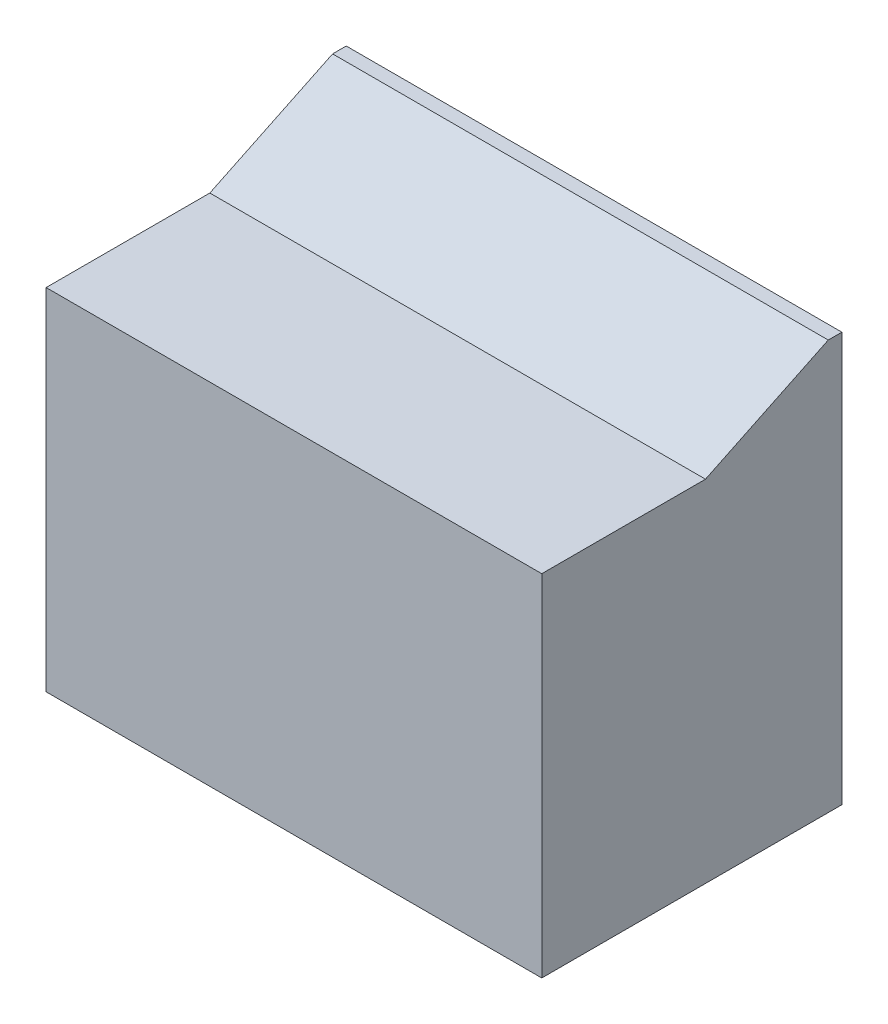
ISO-10303-21;
HEADER;
FILE_DESCRIPTION(('STEP AP214'),'2;1');
FILE_NAME('part.step','',(''),(''),'','','');
FILE_SCHEMA(('AUTOMOTIVE_DESIGN { 1 0 10303 214 1 1 1 1 }'));
ENDSEC;
DATA;
#1=APPLICATION_CONTEXT('core data for automotive mechanical design processes');
#2=APPLICATION_PROTOCOL_DEFINITION('international standard','automotive_design',2000,#1);
#3=PRODUCT_CONTEXT('',#1,'mechanical');
#4=PRODUCT('Part','Part','',(#3));
#5=PRODUCT_RELATED_PRODUCT_CATEGORY('part','',(#4));
#6=PRODUCT_DEFINITION_FORMATION('','',#4);
#7=PRODUCT_DEFINITION_CONTEXT('part definition',#1,'design');
#8=PRODUCT_DEFINITION('design','',#6,#7);
#9=PRODUCT_DEFINITION_SHAPE('','',#8);
#10=(LENGTH_UNIT() NAMED_UNIT(*) SI_UNIT(.MILLI.,.METRE.));
#11=(NAMED_UNIT(*) PLANE_ANGLE_UNIT() SI_UNIT($,.RADIAN.));
#12=(NAMED_UNIT(*) SI_UNIT($,.STERADIAN.) SOLID_ANGLE_UNIT());
#13=UNCERTAINTY_MEASURE_WITH_UNIT(LENGTH_MEASURE(1.E-05),#10,'distance_accuracy_value','');
#14=(GEOMETRIC_REPRESENTATION_CONTEXT(3) GLOBAL_UNCERTAINTY_ASSIGNED_CONTEXT((#13)) GLOBAL_UNIT_ASSIGNED_CONTEXT((#10,
#11,#12)) REPRESENTATION_CONTEXT('',''));
#15=CARTESIAN_POINT('',(0.,0.,0.));
#16=DIRECTION('',(0.,0.,1.));
#17=DIRECTION('',(1.,0.,0.));
#18=AXIS2_PLACEMENT_3D('',#15,#16,#17);
#19=CARTESIAN_POINT('',(-1542.5200318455,386.5,150.));
#20=DIRECTION('',(0.,1.,0.));
#21=DIRECTION('',(-1.,0.,0.));
#22=AXIS2_PLACEMENT_3D('',#19,#20,#21);
#23=PLANE('',#22);
#24=DIRECTION('',(0.,0.,1.));
#25=VECTOR('',#24,1.);
#26=CARTESIAN_POINT('',(-23.5,386.5,330.));
#27=LINE('',#26,#25);
#28=CARTESIAN_POINT('',(-23.5,386.5,329.));
#29=VERTEX_POINT('',#28);
#30=CARTESIAN_POINT('',(-23.4999999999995,386.5,149.771796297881));
#31=VERTEX_POINT('',#30);
#32=EDGE_CURVE('E108',#29,#31,#27,.F.);
#33=ORIENTED_EDGE('',*,*,#32,.F.);
#34=DIRECTION('',(1.,0.,0.));
#35=VECTOR('',#34,1.);
#36=CARTESIAN_POINT('',(-567.5,386.5,329.));
#37=LINE('',#36,#35);
#38=CARTESIAN_POINT('',(-566.5,386.5,329.));
#39=VERTEX_POINT('',#38);
#40=EDGE_CURVE('E19',#29,#39,#37,.F.);
#41=ORIENTED_EDGE('',*,*,#40,.T.);
#42=DIRECTION('',(0.,0.,1.));
#43=VECTOR('',#42,1.);
#44=CARTESIAN_POINT('',(-566.5,386.5,330.));
#45=LINE('',#44,#43);
#46=CARTESIAN_POINT('',(-566.5,386.5,149.771796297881));
#47=VERTEX_POINT('',#46);
#48=EDGE_CURVE('E111',#47,#39,#45,.T.);
#49=ORIENTED_EDGE('',*,*,#48,.F.);
#50=DIRECTION('',(1.,0.,0.));
#51=VECTOR('',#50,1.);
#52=CARTESIAN_POINT('',(-1542.5200318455,386.5,149.771796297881));
#53=LINE('',#52,#51);
#54=EDGE_CURVE('E105',#47,#31,#53,.T.);
#55=ORIENTED_EDGE('',*,*,#54,.T.);
#56=EDGE_LOOP('',(#33,#41,#49,#55));
#57=FACE_BOUND('',#56,.T.);
#58=ADVANCED_FACE('F16',(#57),#23,.F.);
#59=CARTESIAN_POINT('',(-567.5,2.5,329.));
#60=DIRECTION('',(0.,0.,1.));
#61=DIRECTION('',(1.,0.,0.));
#62=AXIS2_PLACEMENT_3D('',#59,#60,#61);
#63=PLANE('',#62);
#64=DIRECTION('',(-1.,0.,0.));
#65=VECTOR('',#64,1.);
#66=CARTESIAN_POINT('',(-567.5,3.5,329.));
#67=LINE('',#66,#65);
#68=CARTESIAN_POINT('',(-566.5,3.5,329.));
#69=VERTEX_POINT('',#68);
#70=CARTESIAN_POINT('',(-23.5,3.5,329.));
#71=VERTEX_POINT('',#70);
#72=EDGE_CURVE('E125',#69,#71,#67,.F.);
#73=ORIENTED_EDGE('',*,*,#72,.F.);
#74=DIRECTION('',(0.,1.,0.));
#75=VECTOR('',#74,1.);
#76=CARTESIAN_POINT('',(-566.5,452.5,329.));
#77=LINE('',#76,#75);
#78=EDGE_CURVE('E137',#39,#69,#77,.F.);
#79=ORIENTED_EDGE('',*,*,#78,.F.);
#80=ORIENTED_EDGE('',*,*,#40,.F.);
#81=DIRECTION('',(0.,1.,0.));
#82=VECTOR('',#81,1.);
#83=CARTESIAN_POINT('',(-23.5,452.5,329.));
#84=LINE('',#83,#82);
#85=EDGE_CURVE('E121',#71,#29,#84,.T.);
#86=ORIENTED_EDGE('',*,*,#85,.F.);
#87=EDGE_LOOP('',(#73,#79,#80,#86));
#88=FACE_BOUND('',#87,.T.);
#89=ADVANCED_FACE('F314',(#88),#63,.F.);
#90=CARTESIAN_POINT('',(-1542.5200318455,451.598998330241,14.5661843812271));
#91=DIRECTION('',(0.,0.9010016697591,0.4338156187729));
#92=DIRECTION('',(0.,-0.4338156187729,0.9010016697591));
#93=AXIS2_PLACEMENT_3D('',#90,#91,#92);
#94=PLANE('',#93);
#95=DIRECTION('',(0.,0.4338156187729,-0.9010016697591));
#96=VECTOR('',#95,1.);
#97=CARTESIAN_POINT('',(-23.5,386.5,149.771796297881));
#98=LINE('',#97,#96);
#99=CARTESIAN_POINT('',(-23.4999999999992,451.5,14.7717962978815));
#100=VERTEX_POINT('',#99);
#101=EDGE_CURVE('E114',#31,#100,#98,.T.);
#102=ORIENTED_EDGE('',*,*,#101,.F.);
#103=ORIENTED_EDGE('',*,*,#54,.F.);
#104=DIRECTION('',(0.,-0.4338156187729,0.9010016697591));
#105=VECTOR('',#104,1.);
#106=CARTESIAN_POINT('',(-566.5,451.5,14.7717962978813));
#107=LINE('',#106,#105);
#108=CARTESIAN_POINT('',(-566.5,451.5,14.7717962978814));
#109=VERTEX_POINT('',#108);
#110=EDGE_CURVE('E134',#109,#47,#107,.T.);
#111=ORIENTED_EDGE('',*,*,#110,.F.);
#112=DIRECTION('',(1.,0.,0.));
#113=VECTOR('',#112,1.);
#114=CARTESIAN_POINT('',(-567.5,451.5,14.7717962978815));
#115=LINE('',#114,#113);
#116=EDGE_CURVE('E118',#100,#109,#115,.F.);
#117=ORIENTED_EDGE('',*,*,#116,.F.);
#118=EDGE_LOOP('',(#102,#103,#111,#117));
#119=FACE_BOUND('',#118,.T.);
#120=ADVANCED_FACE('F116',(#119),#94,.F.);
#121=CARTESIAN_POINT('',(-23.5,452.5,330.));
#122=DIRECTION('',(-1.,0.,0.));
#123=DIRECTION('',(0.,0.,1.));
#124=AXIS2_PLACEMENT_3D('',#121,#122,#123);
#125=PLANE('',#124);
#126=ORIENTED_EDGE('',*,*,#85,.T.);
#127=ORIENTED_EDGE('',*,*,#32,.T.);
#128=ORIENTED_EDGE('',*,*,#101,.T.);
#129=DIRECTION('',(0.,0.,1.));
#130=VECTOR('',#129,1.);
#131=CARTESIAN_POINT('',(-23.5,451.5,330.));
#132=LINE('',#131,#130);
#133=CARTESIAN_POINT('',(-23.5,451.5,0.));
#134=VERTEX_POINT('',#133);
#135=EDGE_CURVE('E147',#134,#100,#132,.T.);
#136=ORIENTED_EDGE('',*,*,#135,.F.);
#137=DIRECTION('',(0.,1.,0.));
#138=VECTOR('',#137,1.);
#139=CARTESIAN_POINT('',(-23.5,2.5,0.));
#140=LINE('',#139,#138);
#141=CARTESIAN_POINT('',(-23.5,3.50000000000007,0.));
#142=VERTEX_POINT('',#141);
#143=EDGE_CURVE('E152',#134,#142,#140,.F.);
#144=ORIENTED_EDGE('',*,*,#143,.T.);
#145=DIRECTION('',(0.,0.,1.));
#146=VECTOR('',#145,1.);
#147=CARTESIAN_POINT('',(-23.5,3.50000000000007,330.));
#148=LINE('',#147,#146);
#149=EDGE_CURVE('E128',#71,#142,#148,.F.);
#150=ORIENTED_EDGE('',*,*,#149,.F.);
#151=EDGE_LOOP('',(#126,#127,#128,#136,#144,#150));
#152=FACE_BOUND('',#151,.T.);
#153=ADVANCED_FACE('F123',(#152),#125,.T.);
#154=CARTESIAN_POINT('',(-567.5,3.5,330.));
#155=DIRECTION('',(0.,1.,0.));
#156=DIRECTION('',(-1.,0.,0.));
#157=AXIS2_PLACEMENT_3D('',#154,#155,#156);
#158=PLANE('',#157);
#159=ORIENTED_EDGE('',*,*,#72,.T.);
#160=ORIENTED_EDGE('',*,*,#149,.T.);
#161=DIRECTION('',(1.,0.,0.));
#162=VECTOR('',#161,1.);
#163=CARTESIAN_POINT('',(-567.5,3.50000000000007,0.));
#164=LINE('',#163,#162);
#165=CARTESIAN_POINT('',(-566.5,3.5,0.));
#166=VERTEX_POINT('',#165);
#167=EDGE_CURVE('E154',#142,#166,#164,.F.);
#168=ORIENTED_EDGE('',*,*,#167,.T.);
#169=DIRECTION('',(0.,0.,1.));
#170=VECTOR('',#169,1.);
#171=CARTESIAN_POINT('',(-566.5,3.5,330.));
#172=LINE('',#171,#170);
#173=EDGE_CURVE('E140',#69,#166,#172,.F.);
#174=ORIENTED_EDGE('',*,*,#173,.F.);
#175=EDGE_LOOP('',(#159,#160,#168,#174));
#176=FACE_BOUND('',#175,.T.);
#177=ADVANCED_FACE('F293',(#176),#158,.T.);
#178=CARTESIAN_POINT('',(-566.5,452.5,330.));
#179=DIRECTION('',(1.,0.,0.));
#180=DIRECTION('',(0.,1.,0.));
#181=AXIS2_PLACEMENT_3D('',#178,#179,#180);
#182=PLANE('',#181);
#183=DIRECTION('',(0.,1.,0.));
#184=VECTOR('',#183,1.);
#185=CARTESIAN_POINT('',(-566.5,2.5,0.));
#186=LINE('',#185,#184);
#187=CARTESIAN_POINT('',(-566.5,451.5,0.));
#188=VERTEX_POINT('',#187);
#189=EDGE_CURVE('E156',#166,#188,#186,.T.);
#190=ORIENTED_EDGE('',*,*,#189,.T.);
#191=DIRECTION('',(0.,0.,1.));
#192=VECTOR('',#191,1.);
#193=CARTESIAN_POINT('',(-566.5,451.5,330.));
#194=LINE('',#193,#192);
#195=EDGE_CURVE('E144',#109,#188,#194,.F.);
#196=ORIENTED_EDGE('',*,*,#195,.F.);
#197=ORIENTED_EDGE('',*,*,#110,.T.);
#198=ORIENTED_EDGE('',*,*,#48,.T.);
#199=ORIENTED_EDGE('',*,*,#78,.T.);
#200=ORIENTED_EDGE('',*,*,#173,.T.);
#201=EDGE_LOOP('',(#190,#196,#197,#198,#199,#200));
#202=FACE_BOUND('',#201,.T.);
#203=ADVANCED_FACE('F285',(#202),#182,.T.);
#204=CARTESIAN_POINT('',(-567.5,451.5,330.));
#205=DIRECTION('',(0.,-1.,0.));
#206=DIRECTION('',(1.,0.,0.));
#207=AXIS2_PLACEMENT_3D('',#204,#205,#206);
#208=PLANE('',#207);
#209=DIRECTION('',(1.,0.,0.));
#210=VECTOR('',#209,1.);
#211=CARTESIAN_POINT('',(-567.5,451.5,0.));
#212=LINE('',#211,#210);
#213=EDGE_CURVE('E158',#188,#134,#212,.T.);
#214=ORIENTED_EDGE('',*,*,#213,.T.);
#215=ORIENTED_EDGE('',*,*,#135,.T.);
#216=ORIENTED_EDGE('',*,*,#116,.T.);
#217=ORIENTED_EDGE('',*,*,#195,.T.);
#218=EDGE_LOOP('',(#214,#215,#216,#217));
#219=FACE_BOUND('',#218,.T.);
#220=ADVANCED_FACE('F278',(#219),#208,.T.);
#221=CARTESIAN_POINT('',(-567.5,452.5,330.));
#222=DIRECTION('',(0.,-1.,0.));
#223=DIRECTION('',(1.,0.,0.));
#224=AXIS2_PLACEMENT_3D('',#221,#222,#223);
#225=PLANE('',#224);
#226=DIRECTION('',(0.,0.,1.));
#227=VECTOR('',#226,1.);
#228=CARTESIAN_POINT('',(-22.5,452.5,330.));
#229=LINE('',#228,#227);
#230=CARTESIAN_POINT('',(-22.4999999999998,452.5,15.));
#231=VERTEX_POINT('',#230);
#232=CARTESIAN_POINT('',(-22.5,452.5,0.));
#233=VERTEX_POINT('',#232);
#234=EDGE_CURVE('E163',#231,#233,#229,.F.);
#235=ORIENTED_EDGE('',*,*,#234,.T.);
#236=DIRECTION('',(1.,0.,0.));
#237=VECTOR('',#236,1.);
#238=CARTESIAN_POINT('',(-567.5,452.5,0.));
#239=LINE('',#238,#237);
#240=CARTESIAN_POINT('',(-567.5,452.5,0.));
#241=VERTEX_POINT('',#240);
#242=EDGE_CURVE('E161',#233,#241,#239,.F.);
#243=ORIENTED_EDGE('',*,*,#242,.T.);
#244=DIRECTION('',(0.,0.,1.));
#245=VECTOR('',#244,1.);
#246=CARTESIAN_POINT('',(-567.5,452.5,330.));
#247=LINE('',#246,#245);
#248=CARTESIAN_POINT('',(-567.5,452.5,15.));
#249=VERTEX_POINT('',#248);
#250=EDGE_CURVE('E180',#241,#249,#247,.T.);
#251=ORIENTED_EDGE('',*,*,#250,.T.);
#252=DIRECTION('',(1.,0.,0.));
#253=VECTOR('',#252,1.);
#254=CARTESIAN_POINT('',(-1542.5200318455,452.5,14.9999999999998));
#255=LINE('',#254,#253);
#256=EDGE_CURVE('E149',#231,#249,#255,.F.);
#257=ORIENTED_EDGE('',*,*,#256,.F.);
#258=EDGE_LOOP('',(#235,#243,#251,#257));
#259=FACE_BOUND('',#258,.T.);
#260=ADVANCED_FACE('F213',(#259),#225,.F.);
#261=CARTESIAN_POINT('',(-1542.5200318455,452.5,15.));
#262=DIRECTION('',(0.,0.9010016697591,0.4338156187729));
#263=DIRECTION('',(0.,-0.4338156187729,0.9010016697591));
#264=AXIS2_PLACEMENT_3D('',#261,#262,#263);
#265=PLANE('',#264);
#266=DIRECTION('',(-1.,0.,0.));
#267=VECTOR('',#266,1.);
#268=CARTESIAN_POINT('',(-1542.5200318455,387.5,150.));
#269=LINE('',#268,#267);
#270=CARTESIAN_POINT('',(-22.4999999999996,387.5,150.));
#271=VERTEX_POINT('',#270);
#272=CARTESIAN_POINT('',(-567.5,387.5,150.));
#273=VERTEX_POINT('',#272);
#274=EDGE_CURVE('E170',#271,#273,#269,.T.);
#275=ORIENTED_EDGE('',*,*,#274,.F.);
#276=DIRECTION('',(0.,0.4338156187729,-0.9010016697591));
#277=VECTOR('',#276,1.);
#278=CARTESIAN_POINT('',(-22.5,387.5,150.));
#279=LINE('',#278,#277);
#280=EDGE_CURVE('E167',#271,#231,#279,.T.);
#281=ORIENTED_EDGE('',*,*,#280,.T.);
#282=ORIENTED_EDGE('',*,*,#256,.T.);
#283=DIRECTION('',(0.,-0.4338156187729,0.9010016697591));
#284=VECTOR('',#283,1.);
#285=CARTESIAN_POINT('',(-567.5,452.5,15.));
#286=LINE('',#285,#284);
#287=EDGE_CURVE('E182',#249,#273,#286,.T.);
#288=ORIENTED_EDGE('',*,*,#287,.T.);
#289=EDGE_LOOP('',(#275,#281,#282,#288));
#290=FACE_BOUND('',#289,.T.);
#291=ADVANCED_FACE('F210',(#290),#265,.T.);
#292=CARTESIAN_POINT('',(-567.5,2.5,0.));
#293=DIRECTION('',(0.,0.,1.));
#294=DIRECTION('',(1.,0.,0.));
#295=AXIS2_PLACEMENT_3D('',#292,#293,#294);
#296=PLANE('',#295);
#297=ORIENTED_EDGE('',*,*,#242,.F.);
#298=DIRECTION('',(0.,1.,0.));
#299=VECTOR('',#298,1.);
#300=CARTESIAN_POINT('',(-22.5,452.5,0.));
#301=LINE('',#300,#299);
#302=CARTESIAN_POINT('',(-22.5,2.50000000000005,0.));
#303=VERTEX_POINT('',#302);
#304=EDGE_CURVE('E165',#233,#303,#301,.F.);
#305=ORIENTED_EDGE('',*,*,#304,.T.);
#306=DIRECTION('',(-1.,0.,0.));
#307=VECTOR('',#306,1.);
#308=CARTESIAN_POINT('',(-567.5,2.5,0.));
#309=LINE('',#308,#307);
#310=CARTESIAN_POINT('',(-567.5,2.5,0.));
#311=VERTEX_POINT('',#310);
#312=EDGE_CURVE('E189',#303,#311,#309,.T.);
#313=ORIENTED_EDGE('',*,*,#312,.T.);
#314=DIRECTION('',(0.,1.,0.));
#315=VECTOR('',#314,1.);
#316=CARTESIAN_POINT('',(-567.5,452.5,0.));
#317=LINE('',#316,#315);
#318=EDGE_CURVE('E177',#311,#241,#317,.T.);
#319=ORIENTED_EDGE('',*,*,#318,.T.);
#320=EDGE_LOOP('',(#297,#305,#313,#319));
#321=FACE_BOUND('',#320,.T.);
#322=ORIENTED_EDGE('',*,*,#189,.F.);
#323=ORIENTED_EDGE('',*,*,#167,.F.);
#324=ORIENTED_EDGE('',*,*,#143,.F.);
#325=ORIENTED_EDGE('',*,*,#213,.F.);
#326=EDGE_LOOP('',(#322,#323,#324,#325));
#327=FACE_BOUND('',#326,.T.);
#328=ADVANCED_FACE('F217',(#321,#327),#296,.F.);
#329=CARTESIAN_POINT('',(-22.5,452.5,330.));
#330=DIRECTION('',(-1.,0.,0.));
#331=DIRECTION('',(0.,0.,1.));
#332=AXIS2_PLACEMENT_3D('',#329,#330,#331);
#333=PLANE('',#332);
#334=DIRECTION('',(0.,0.,1.));
#335=VECTOR('',#334,1.);
#336=CARTESIAN_POINT('',(-22.5,387.5,150.));
#337=LINE('',#336,#335);
#338=CARTESIAN_POINT('',(-22.5,387.5,330.));
#339=VERTEX_POINT('',#338);
#340=EDGE_CURVE('E172',#339,#271,#337,.F.);
#341=ORIENTED_EDGE('',*,*,#340,.F.);
#342=DIRECTION('',(0.,1.,0.));
#343=VECTOR('',#342,1.);
#344=CARTESIAN_POINT('',(-22.5,2.5,330.));
#345=LINE('',#344,#343);
#346=CARTESIAN_POINT('',(-22.5,2.50000000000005,330.));
#347=VERTEX_POINT('',#346);
#348=EDGE_CURVE('E192',#347,#339,#345,.T.);
#349=ORIENTED_EDGE('',*,*,#348,.F.);
#350=DIRECTION('',(0.,0.,1.));
#351=VECTOR('',#350,1.);
#352=CARTESIAN_POINT('',(-22.5,2.50000000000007,330.));
#353=LINE('',#352,#351);
#354=EDGE_CURVE('E186',#347,#303,#353,.F.);
#355=ORIENTED_EDGE('',*,*,#354,.T.);
#356=ORIENTED_EDGE('',*,*,#304,.F.);
#357=ORIENTED_EDGE('',*,*,#234,.F.);
#358=ORIENTED_EDGE('',*,*,#280,.F.);
#359=EDGE_LOOP('',(#341,#349,#355,#356,#357,#358));
#360=FACE_BOUND('',#359,.T.);
#361=ADVANCED_FACE('F224',(#360),#333,.F.);
#362=CARTESIAN_POINT('',(-1542.5200318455,387.5,150.));
#363=DIRECTION('',(0.,1.,0.));
#364=DIRECTION('',(-1.,0.,0.));
#365=AXIS2_PLACEMENT_3D('',#362,#363,#364);
#366=PLANE('',#365);
#367=DIRECTION('',(1.,0.,0.));
#368=VECTOR('',#367,1.);
#369=CARTESIAN_POINT('',(-567.5,387.5,330.));
#370=LINE('',#369,#368);
#371=CARTESIAN_POINT('',(-567.5,387.5,330.));
#372=VERTEX_POINT('',#371);
#373=EDGE_CURVE('E195',#339,#372,#370,.F.);
#374=ORIENTED_EDGE('',*,*,#373,.F.);
#375=ORIENTED_EDGE('',*,*,#340,.T.);
#376=ORIENTED_EDGE('',*,*,#274,.T.);
#377=DIRECTION('',(0.,0.,1.));
#378=VECTOR('',#377,1.);
#379=CARTESIAN_POINT('',(-567.5,387.5,330.));
#380=LINE('',#379,#378);
#381=EDGE_CURVE('E175',#273,#372,#380,.T.);
#382=ORIENTED_EDGE('',*,*,#381,.T.);
#383=EDGE_LOOP('',(#374,#375,#376,#382));
#384=FACE_BOUND('',#383,.T.);
#385=ADVANCED_FACE('F207',(#384),#366,.T.);
#386=CARTESIAN_POINT('',(-567.5,452.5,330.));
#387=DIRECTION('',(1.,0.,0.));
#388=DIRECTION('',(0.,1.,0.));
#389=AXIS2_PLACEMENT_3D('',#386,#387,#388);
#390=PLANE('',#389);
#391=ORIENTED_EDGE('',*,*,#250,.F.);
#392=ORIENTED_EDGE('',*,*,#318,.F.);
#393=DIRECTION('',(0.,0.,1.));
#394=VECTOR('',#393,1.);
#395=CARTESIAN_POINT('',(-567.5,2.5,330.));
#396=LINE('',#395,#394);
#397=CARTESIAN_POINT('',(-567.5,2.5,330.));
#398=VERTEX_POINT('',#397);
#399=EDGE_CURVE('E34',#311,#398,#396,.T.);
#400=ORIENTED_EDGE('',*,*,#399,.T.);
#401=DIRECTION('',(0.,1.,0.));
#402=VECTOR('',#401,1.);
#403=CARTESIAN_POINT('',(-567.5,2.5,330.));
#404=LINE('',#403,#402);
#405=EDGE_CURVE('E25',#372,#398,#404,.F.);
#406=ORIENTED_EDGE('',*,*,#405,.F.);
#407=ORIENTED_EDGE('',*,*,#381,.F.);
#408=ORIENTED_EDGE('',*,*,#287,.F.);
#409=EDGE_LOOP('',(#391,#392,#400,#406,#407,#408));
#410=FACE_BOUND('',#409,.T.);
#411=ADVANCED_FACE('F204',(#410),#390,.F.);
#412=CARTESIAN_POINT('',(-567.5,2.5,330.));
#413=DIRECTION('',(0.,1.,0.));
#414=DIRECTION('',(-1.,0.,0.));
#415=AXIS2_PLACEMENT_3D('',#412,#413,#414);
#416=PLANE('',#415);
#417=ORIENTED_EDGE('',*,*,#354,.F.);
#418=DIRECTION('',(1.,0.,0.));
#419=VECTOR('',#418,1.);
#420=CARTESIAN_POINT('',(-567.5,2.5,330.));
#421=LINE('',#420,#419);
#422=EDGE_CURVE('E11',#398,#347,#421,.T.);
#423=ORIENTED_EDGE('',*,*,#422,.F.);
#424=ORIENTED_EDGE('',*,*,#399,.F.);
#425=ORIENTED_EDGE('',*,*,#312,.F.);
#426=EDGE_LOOP('',(#417,#423,#424,#425));
#427=FACE_BOUND('',#426,.T.);
#428=ADVANCED_FACE('F222',(#427),#416,.F.);
#429=CARTESIAN_POINT('',(-567.5,2.5,330.));
#430=DIRECTION('',(0.,0.,1.));
#431=DIRECTION('',(1.,0.,0.));
#432=AXIS2_PLACEMENT_3D('',#429,#430,#431);
#433=PLANE('',#432);
#434=ORIENTED_EDGE('',*,*,#405,.T.);
#435=ORIENTED_EDGE('',*,*,#422,.T.);
#436=ORIENTED_EDGE('',*,*,#348,.T.);
#437=ORIENTED_EDGE('',*,*,#373,.T.);
#438=EDGE_LOOP('',(#434,#435,#436,#437));
#439=FACE_BOUND('',#438,.T.);
#440=ADVANCED_FACE('F200',(#439),#433,.T.);
#441=CLOSED_SHELL('',(#58,#89,#120,#153,#177,#203,#220,#260,#291,#328,#361,#385,#411,#428,#440));
#442=MANIFOLD_SOLID_BREP('B1',#441);
#443=ADVANCED_BREP_SHAPE_REPRESENTATION('',(#18,#442),#14);
#444=SHAPE_DEFINITION_REPRESENTATION(#9,#443);
ENDSEC;
END-ISO-10303-21;
